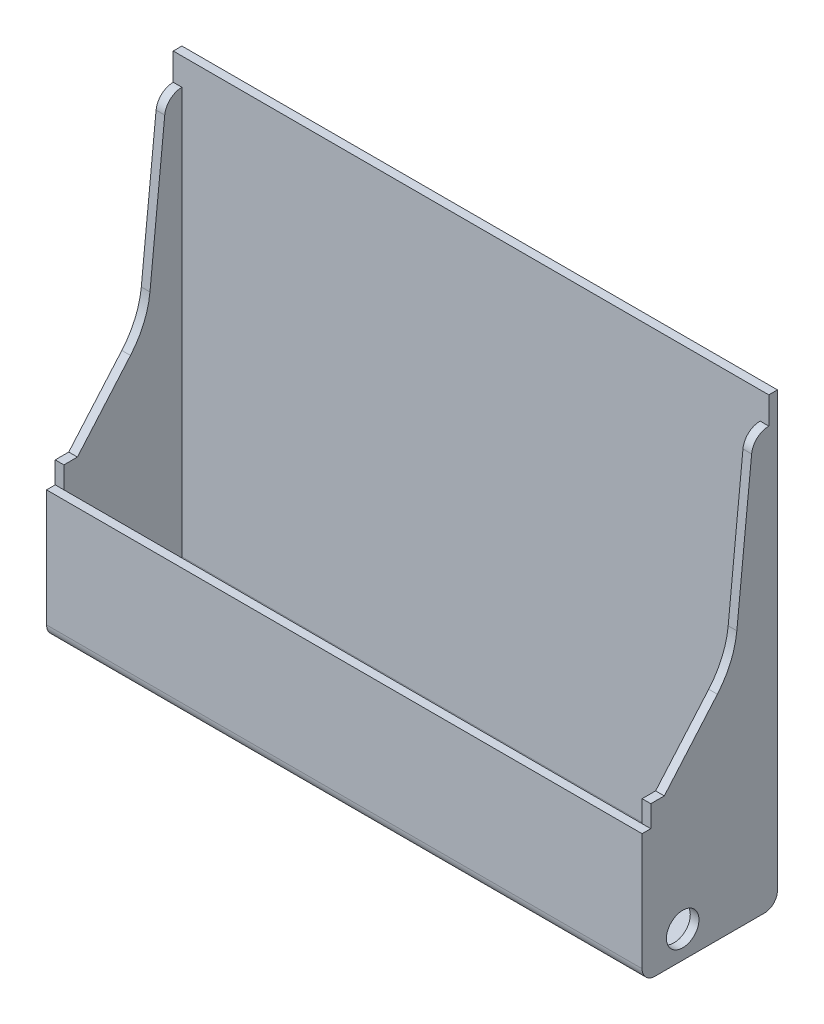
ISO-10303-21;
HEADER;
FILE_DESCRIPTION(('STEP AP214'),'2;1');
FILE_NAME('part.step','',(''),(''),'','','');
FILE_SCHEMA(('AUTOMOTIVE_DESIGN { 1 0 10303 214 1 1 1 1 }'));
ENDSEC;
DATA;
#1=APPLICATION_CONTEXT('core data for automotive mechanical design processes');
#2=APPLICATION_PROTOCOL_DEFINITION('international standard','automotive_design',2000,#1);
#3=PRODUCT_CONTEXT('',#1,'mechanical');
#4=PRODUCT('Part','Part','',(#3));
#5=PRODUCT_RELATED_PRODUCT_CATEGORY('part','',(#4));
#6=PRODUCT_DEFINITION_FORMATION('','',#4);
#7=PRODUCT_DEFINITION_CONTEXT('part definition',#1,'design');
#8=PRODUCT_DEFINITION('design','',#6,#7);
#9=PRODUCT_DEFINITION_SHAPE('','',#8);
#10=(LENGTH_UNIT() NAMED_UNIT(*) SI_UNIT(.MILLI.,.METRE.));
#11=(NAMED_UNIT(*) PLANE_ANGLE_UNIT() SI_UNIT($,.RADIAN.));
#12=(NAMED_UNIT(*) SI_UNIT($,.STERADIAN.) SOLID_ANGLE_UNIT());
#13=UNCERTAINTY_MEASURE_WITH_UNIT(LENGTH_MEASURE(1.E-05),#10,'distance_accuracy_value','');
#14=(GEOMETRIC_REPRESENTATION_CONTEXT(3) GLOBAL_UNCERTAINTY_ASSIGNED_CONTEXT((#13)) GLOBAL_UNIT_ASSIGNED_CONTEXT((#10,
#11,#12)) REPRESENTATION_CONTEXT('',''));
#15=CARTESIAN_POINT('',(0.,0.,0.));
#16=DIRECTION('',(0.,0.,1.));
#17=DIRECTION('',(1.,0.,0.));
#18=AXIS2_PLACEMENT_3D('',#15,#16,#17);
#19=CARTESIAN_POINT('',(-34.925,52.3875,15.875));
#20=DIRECTION('',(0.,-1.,0.));
#21=DIRECTION('',(0.,0.,-1.));
#22=AXIS2_PLACEMENT_3D('',#19,#20,#21);
#23=PLANE('',#22);
#24=DIRECTION('',(0.,0.,-1.));
#25=VECTOR('',#24,1.);
#26=CARTESIAN_POINT('',(-34.925,52.3875,15.875));
#27=LINE('',#26,#25);
#28=CARTESIAN_POINT('',(-34.925,52.3875,1.016));
#29=VERTEX_POINT('',#28);
#30=CARTESIAN_POINT('',(-34.925,52.3875,0.));
#31=VERTEX_POINT('',#30);
#32=EDGE_CURVE('E359',#29,#31,#27,.T.);
#33=ORIENTED_EDGE('',*,*,#32,.F.);
#34=DIRECTION('',(-1.,0.,0.));
#35=VECTOR('',#34,1.);
#36=CARTESIAN_POINT('',(-34.925,52.3875,1.016));
#37=LINE('',#36,#35);
#38=CARTESIAN_POINT('',(34.925,52.3875,1.016));
#39=VERTEX_POINT('',#38);
#40=EDGE_CURVE('E326',#39,#29,#37,.T.);
#41=ORIENTED_EDGE('',*,*,#40,.F.);
#42=DIRECTION('',(0.,0.,-1.));
#43=VECTOR('',#42,1.);
#44=CARTESIAN_POINT('',(34.925,52.3875,15.875));
#45=LINE('',#44,#43);
#46=CARTESIAN_POINT('',(34.925,52.3875,0.));
#47=VERTEX_POINT('',#46);
#48=EDGE_CURVE('E227',#39,#47,#45,.T.);
#49=ORIENTED_EDGE('',*,*,#48,.T.);
#50=DIRECTION('',(-1.,0.,0.));
#51=VECTOR('',#50,1.);
#52=CARTESIAN_POINT('',(-34.925,52.3875,0.));
#53=LINE('',#52,#51);
#54=EDGE_CURVE('E352',#47,#31,#53,.T.);
#55=ORIENTED_EDGE('',*,*,#54,.T.);
#56=EDGE_LOOP('',(#33,#41,#49,#55));
#57=FACE_BOUND('',#56,.T.);
#58=ADVANCED_FACE('F31',(#57),#23,.F.);
#59=CARTESIAN_POINT('',(-34.925,0.,15.875));
#60=DIRECTION('',(1.,0.,0.));
#61=DIRECTION('',(0.,0.,-1.));
#62=AXIS2_PLACEMENT_3D('',#59,#60,#61);
#63=PLANE('',#62);
#64=CARTESIAN_POINT('',(-34.925,3.175,11.1125));
#65=DIRECTION('',(1.,0.,0.));
#66=DIRECTION('',(0.,0.,-1.));
#67=AXIS2_PLACEMENT_3D('',#64,#65,#66);
#68=CIRCLE('',#67,1.905);
#69=CARTESIAN_POINT('',(-34.925,3.175,9.2075));
#70=VERTEX_POINT('',#69);
#71=EDGE_CURVE('E733',#70,#70,#68,.T.);
#72=ORIENTED_EDGE('',*,*,#71,.T.);
#73=EDGE_LOOP('',(#72));
#74=FACE_BOUND('',#73,.T.);
#75=DIRECTION('',(0.,-1.,0.));
#76=VECTOR('',#75,1.);
#77=CARTESIAN_POINT('',(-34.925,0.,15.875));
#78=LINE('',#77,#76);
#79=CARTESIAN_POINT('',(-34.925,15.24,15.875));
#80=VERTEX_POINT('',#79);
#81=CARTESIAN_POINT('',(-34.925,1.524,15.875));
#82=VERTEX_POINT('',#81);
#83=EDGE_CURVE('E55',#80,#82,#78,.T.);
#84=ORIENTED_EDGE('',*,*,#83,.F.);
#85=DIRECTION('',(0.,0.,-1.));
#86=VECTOR('',#85,1.);
#87=CARTESIAN_POINT('',(-34.925,15.24,14.859));
#88=LINE('',#87,#86);
#89=CARTESIAN_POINT('',(-34.925,15.24,14.859));
#90=VERTEX_POINT('',#89);
#91=EDGE_CURVE('E253',#80,#90,#88,.T.);
#92=ORIENTED_EDGE('',*,*,#91,.T.);
#93=DIRECTION('',(0.,1.,0.));
#94=VECTOR('',#93,1.);
#95=CARTESIAN_POINT('',(-34.925,17.78,14.859));
#96=LINE('',#95,#94);
#97=CARTESIAN_POINT('',(-34.925,17.78,14.859));
#98=VERTEX_POINT('',#97);
#99=EDGE_CURVE('E256',#90,#98,#96,.T.);
#100=ORIENTED_EDGE('',*,*,#99,.T.);
#101=DIRECTION('',(0.,0.,-1.));
#102=VECTOR('',#101,1.);
#103=CARTESIAN_POINT('',(-34.925,17.78,13.2715));
#104=LINE('',#103,#102);
#105=CARTESIAN_POINT('',(-34.925,17.78,13.2715));
#106=VERTEX_POINT('',#105);
#107=EDGE_CURVE('E259',#98,#106,#104,.T.);
#108=ORIENTED_EDGE('',*,*,#107,.T.);
#109=DIRECTION('',(0.,0.756920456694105,-0.653507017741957));
#110=VECTOR('',#109,1.);
#111=CARTESIAN_POINT('',(-34.925,24.9896673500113,7.04684565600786));
#112=LINE('',#111,#110);
#113=CARTESIAN_POINT('',(-34.925,24.9896673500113,7.04684565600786));
#114=VERTEX_POINT('',#113);
#115=EDGE_CURVE('E262',#106,#114,#112,.T.);
#116=ORIENTED_EDGE('',*,*,#115,.T.);
#117=CARTESIAN_POINT('',(-34.925,31.2626455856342,14.3124838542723));
#118=DIRECTION('',(1.,0.,0.));
#119=DIRECTION('',(0.,0.,1.));
#120=AXIS2_PLACEMENT_3D('',#117,#118,#119);
#121=CIRCLE('',#120,9.59894548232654);
#122=CARTESIAN_POINT('',(-34.925,30.2943673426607,4.7625));
#123=VERTEX_POINT('',#122);
#124=EDGE_CURVE('E265',#114,#123,#121,.T.);
#125=ORIENTED_EDGE('',*,*,#124,.T.);
#126=DIRECTION('',(0.,0.994899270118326,-0.100873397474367));
#127=VECTOR('',#126,1.);
#128=CARTESIAN_POINT('',(-34.925,47.3934461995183,3.0288147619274));
#129=LINE('',#128,#127);
#130=CARTESIAN_POINT('',(-34.925,47.3934461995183,3.0288147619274));
#131=VERTEX_POINT('',#130);
#132=EDGE_CURVE('E212',#123,#131,#129,.T.);
#133=ORIENTED_EDGE('',*,*,#132,.T.);
#134=CARTESIAN_POINT('',(-34.925,47.1893657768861,1.016));
#135=DIRECTION('',(-1.,0.,0.));
#136=DIRECTION('',(0.,0.,-1.));
#137=AXIS2_PLACEMENT_3D('',#134,#135,#136);
#138=CIRCLE('',#137,2.02313422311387);
#139=CARTESIAN_POINT('',(-34.925,49.2125,1.016));
#140=VERTEX_POINT('',#139);
#141=EDGE_CURVE('E247',#131,#140,#138,.T.);
#142=ORIENTED_EDGE('',*,*,#141,.T.);
#143=DIRECTION('',(0.,1.,0.));
#144=VECTOR('',#143,1.);
#145=CARTESIAN_POINT('',(-34.925,49.2125,1.016));
#146=LINE('',#145,#144);
#147=EDGE_CURVE('E250',#140,#29,#146,.T.);
#148=ORIENTED_EDGE('',*,*,#147,.T.);
#149=ORIENTED_EDGE('',*,*,#32,.T.);
#150=DIRECTION('',(0.,-1.,0.));
#151=VECTOR('',#150,1.);
#152=CARTESIAN_POINT('',(-34.925,0.,0.));
#153=LINE('',#152,#151);
#154=CARTESIAN_POINT('',(-34.925,1.524,0.));
#155=VERTEX_POINT('',#154);
#156=EDGE_CURVE('E344',#31,#155,#153,.T.);
#157=ORIENTED_EDGE('',*,*,#156,.T.);
#158=CARTESIAN_POINT('',(-34.925,1.524,1.524));
#159=DIRECTION('',(1.,0.,0.));
#160=DIRECTION('',(0.,0.,-1.));
#161=AXIS2_PLACEMENT_3D('',#158,#159,#160);
#162=CIRCLE('',#161,1.524);
#163=CARTESIAN_POINT('',(-34.925,0.,1.524));
#164=VERTEX_POINT('',#163);
#165=EDGE_CURVE('E381',#155,#164,#162,.F.);
#166=ORIENTED_EDGE('',*,*,#165,.T.);
#167=DIRECTION('',(0.,0.,-1.));
#168=VECTOR('',#167,1.);
#169=CARTESIAN_POINT('',(-34.925,0.,15.875));
#170=LINE('',#169,#168);
#171=CARTESIAN_POINT('',(-34.925,0.,14.351));
#172=VERTEX_POINT('',#171);
#173=EDGE_CURVE('E365',#172,#164,#170,.T.);
#174=ORIENTED_EDGE('',*,*,#173,.F.);
#175=CARTESIAN_POINT('',(-34.925,1.524,14.351));
#176=DIRECTION('',(1.,0.,0.));
#177=DIRECTION('',(0.,0.,-1.));
#178=AXIS2_PLACEMENT_3D('',#175,#176,#177);
#179=CIRCLE('',#178,1.524);
#180=EDGE_CURVE('E379',#172,#82,#179,.F.);
#181=ORIENTED_EDGE('',*,*,#180,.T.);
#182=EDGE_LOOP('',(#84,#92,#100,#108,#116,#125,#133,#142,#148,#149,#157,#166,#174,#181));
#183=FACE_BOUND('',#182,.T.);
#184=ADVANCED_FACE('F33',(#74,#183),#63,.F.);
#185=CARTESIAN_POINT('',(-34.925,0.,15.875));
#186=DIRECTION('',(0.,1.,0.));
#187=DIRECTION('',(0.,0.,1.));
#188=AXIS2_PLACEMENT_3D('',#185,#186,#187);
#189=PLANE('',#188);
#190=ORIENTED_EDGE('',*,*,#173,.T.);
#191=DIRECTION('',(1.,0.,0.));
#192=VECTOR('',#191,1.);
#193=CARTESIAN_POINT('',(34.925,0.,1.524));
#194=LINE('',#193,#192);
#195=CARTESIAN_POINT('',(34.925,0.,1.524));
#196=VERTEX_POINT('',#195);
#197=EDGE_CURVE('E370',#164,#196,#194,.T.);
#198=ORIENTED_EDGE('',*,*,#197,.T.);
#199=DIRECTION('',(0.,0.,-1.));
#200=VECTOR('',#199,1.);
#201=CARTESIAN_POINT('',(34.925,0.,15.875));
#202=LINE('',#201,#200);
#203=CARTESIAN_POINT('',(34.925,0.,14.351));
#204=VERTEX_POINT('',#203);
#205=EDGE_CURVE('E362',#204,#196,#202,.T.);
#206=ORIENTED_EDGE('',*,*,#205,.F.);
#207=DIRECTION('',(1.,0.,0.));
#208=VECTOR('',#207,1.);
#209=CARTESIAN_POINT('',(-34.925,0.,14.351));
#210=LINE('',#209,#208);
#211=EDGE_CURVE('E368',#204,#172,#210,.F.);
#212=ORIENTED_EDGE('',*,*,#211,.T.);
#213=EDGE_LOOP('',(#190,#198,#206,#212));
#214=FACE_BOUND('',#213,.T.);
#215=ADVANCED_FACE('F450',(#214),#189,.F.);
#216=CARTESIAN_POINT('',(34.925,0.,15.875));
#217=DIRECTION('',(-1.,0.,0.));
#218=DIRECTION('',(0.,0.,1.));
#219=AXIS2_PLACEMENT_3D('',#216,#217,#218);
#220=PLANE('',#219);
#221=CARTESIAN_POINT('',(34.925,3.175,11.1125));
#222=DIRECTION('',(1.,0.,0.));
#223=DIRECTION('',(0.,0.,-1.));
#224=AXIS2_PLACEMENT_3D('',#221,#222,#223);
#225=CIRCLE('',#224,1.905);
#226=CARTESIAN_POINT('',(34.925,3.175,9.2075));
#227=VERTEX_POINT('',#226);
#228=EDGE_CURVE('E732',#227,#227,#225,.T.);
#229=ORIENTED_EDGE('',*,*,#228,.F.);
#230=EDGE_LOOP('',(#229));
#231=FACE_BOUND('',#230,.T.);
#232=DIRECTION('',(0.,1.,0.));
#233=VECTOR('',#232,1.);
#234=CARTESIAN_POINT('',(34.925,17.78,14.859));
#235=LINE('',#234,#233);
#236=CARTESIAN_POINT('',(34.925,15.24,14.859));
#237=VERTEX_POINT('',#236);
#238=CARTESIAN_POINT('',(34.925,17.78,14.859));
#239=VERTEX_POINT('',#238);
#240=EDGE_CURVE('E230',#237,#239,#235,.T.);
#241=ORIENTED_EDGE('',*,*,#240,.F.);
#242=DIRECTION('',(0.,0.,-1.));
#243=VECTOR('',#242,1.);
#244=CARTESIAN_POINT('',(34.925,15.24,14.859));
#245=LINE('',#244,#243);
#246=CARTESIAN_POINT('',(34.925,15.24,15.875));
#247=VERTEX_POINT('',#246);
#248=EDGE_CURVE('E228',#247,#237,#245,.T.);
#249=ORIENTED_EDGE('',*,*,#248,.F.);
#250=DIRECTION('',(0.,1.,0.));
#251=VECTOR('',#250,1.);
#252=CARTESIAN_POINT('',(34.925,0.,15.875));
#253=LINE('',#252,#251);
#254=CARTESIAN_POINT('',(34.925,1.524,15.875));
#255=VERTEX_POINT('',#254);
#256=EDGE_CURVE('E356',#255,#247,#253,.T.);
#257=ORIENTED_EDGE('',*,*,#256,.F.);
#258=CARTESIAN_POINT('',(34.925,1.524,14.351));
#259=DIRECTION('',(-1.,0.,0.));
#260=DIRECTION('',(0.,0.,1.));
#261=AXIS2_PLACEMENT_3D('',#258,#259,#260);
#262=CIRCLE('',#261,1.524);
#263=EDGE_CURVE('E373',#255,#204,#262,.F.);
#264=ORIENTED_EDGE('',*,*,#263,.T.);
#265=ORIENTED_EDGE('',*,*,#205,.T.);
#266=CARTESIAN_POINT('',(34.925,1.524,1.524));
#267=DIRECTION('',(-1.,0.,0.));
#268=DIRECTION('',(0.,0.,1.));
#269=AXIS2_PLACEMENT_3D('',#266,#267,#268);
#270=CIRCLE('',#269,1.524);
#271=CARTESIAN_POINT('',(34.925,1.524,0.));
#272=VERTEX_POINT('',#271);
#273=EDGE_CURVE('E375',#196,#272,#270,.F.);
#274=ORIENTED_EDGE('',*,*,#273,.T.);
#275=DIRECTION('',(0.,1.,0.));
#276=VECTOR('',#275,1.);
#277=CARTESIAN_POINT('',(34.925,0.,0.));
#278=LINE('',#277,#276);
#279=EDGE_CURVE('E350',#272,#47,#278,.T.);
#280=ORIENTED_EDGE('',*,*,#279,.T.);
#281=ORIENTED_EDGE('',*,*,#48,.F.);
#282=DIRECTION('',(0.,1.,0.));
#283=VECTOR('',#282,1.);
#284=CARTESIAN_POINT('',(34.925,49.2125,1.016));
#285=LINE('',#284,#283);
#286=CARTESIAN_POINT('',(34.925,49.2125,1.016));
#287=VERTEX_POINT('',#286);
#288=EDGE_CURVE('E204',#287,#39,#285,.T.);
#289=ORIENTED_EDGE('',*,*,#288,.F.);
#290=CARTESIAN_POINT('',(34.925,47.1893657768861,1.016));
#291=DIRECTION('',(-1.,0.,0.));
#292=DIRECTION('',(0.,0.,-1.));
#293=AXIS2_PLACEMENT_3D('',#290,#291,#292);
#294=CIRCLE('',#293,2.02313422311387);
#295=CARTESIAN_POINT('',(34.925,47.3934461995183,3.0288147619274));
#296=VERTEX_POINT('',#295);
#297=EDGE_CURVE('E215',#296,#287,#294,.T.);
#298=ORIENTED_EDGE('',*,*,#297,.F.);
#299=DIRECTION('',(0.,0.994899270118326,-0.100873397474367));
#300=VECTOR('',#299,1.);
#301=CARTESIAN_POINT('',(34.925,47.3934461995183,3.0288147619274));
#302=LINE('',#301,#300);
#303=CARTESIAN_POINT('',(34.925,30.2943673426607,4.7625));
#304=VERTEX_POINT('',#303);
#305=EDGE_CURVE('E245',#304,#296,#302,.T.);
#306=ORIENTED_EDGE('',*,*,#305,.F.);
#307=CARTESIAN_POINT('',(34.925,31.2626455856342,14.3124838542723));
#308=DIRECTION('',(1.,0.,0.));
#309=DIRECTION('',(0.,0.,1.));
#310=AXIS2_PLACEMENT_3D('',#307,#308,#309);
#311=CIRCLE('',#310,9.59894548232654);
#312=CARTESIAN_POINT('',(34.925,24.9896673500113,7.04684565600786));
#313=VERTEX_POINT('',#312);
#314=EDGE_CURVE('E242',#313,#304,#311,.T.);
#315=ORIENTED_EDGE('',*,*,#314,.F.);
#316=DIRECTION('',(0.,0.756920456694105,-0.653507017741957));
#317=VECTOR('',#316,1.);
#318=CARTESIAN_POINT('',(34.925,24.9896673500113,7.04684565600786));
#319=LINE('',#318,#317);
#320=CARTESIAN_POINT('',(34.925,17.78,13.2715));
#321=VERTEX_POINT('',#320);
#322=EDGE_CURVE('E239',#321,#313,#319,.T.);
#323=ORIENTED_EDGE('',*,*,#322,.F.);
#324=DIRECTION('',(0.,0.,-1.));
#325=VECTOR('',#324,1.);
#326=CARTESIAN_POINT('',(34.925,17.78,13.2715));
#327=LINE('',#326,#325);
#328=EDGE_CURVE('E236',#239,#321,#327,.T.);
#329=ORIENTED_EDGE('',*,*,#328,.F.);
#330=EDGE_LOOP('',(#241,#249,#257,#264,#265,#274,#280,#281,#289,#298,#306,#315,#323,#329));
#331=FACE_BOUND('',#330,.T.);
#332=ADVANCED_FACE('F225',(#231,#331),#220,.F.);
#333=CARTESIAN_POINT('',(-34.925,52.3875,15.875));
#334=DIRECTION('',(0.,0.,-1.));
#335=DIRECTION('',(-1.,0.,0.));
#336=AXIS2_PLACEMENT_3D('',#333,#334,#335);
#337=PLANE('',#336);
#338=ORIENTED_EDGE('',*,*,#256,.T.);
#339=DIRECTION('',(1.,0.,0.));
#340=VECTOR('',#339,1.);
#341=CARTESIAN_POINT('',(-34.925,15.24,15.875));
#342=LINE('',#341,#340);
#343=EDGE_CURVE('E293',#80,#247,#342,.T.);
#344=ORIENTED_EDGE('',*,*,#343,.F.);
#345=ORIENTED_EDGE('',*,*,#83,.T.);
#346=DIRECTION('',(1.,0.,0.));
#347=VECTOR('',#346,1.);
#348=CARTESIAN_POINT('',(-34.925,1.524,15.875));
#349=LINE('',#348,#347);
#350=EDGE_CURVE('E383',#82,#255,#349,.T.);
#351=ORIENTED_EDGE('',*,*,#350,.T.);
#352=EDGE_LOOP('',(#338,#344,#345,#351));
#353=FACE_BOUND('',#352,.T.);
#354=ADVANCED_FACE('F443',(#353),#337,.F.);
#355=CARTESIAN_POINT('',(-34.925,52.3875,0.));
#356=DIRECTION('',(0.,0.,-1.));
#357=DIRECTION('',(-1.,0.,0.));
#358=AXIS2_PLACEMENT_3D('',#355,#356,#357);
#359=PLANE('',#358);
#360=ORIENTED_EDGE('',*,*,#279,.F.);
#361=DIRECTION('',(1.,0.,0.));
#362=VECTOR('',#361,1.);
#363=CARTESIAN_POINT('',(-34.925,1.524,0.));
#364=LINE('',#363,#362);
#365=EDGE_CURVE('E377',#272,#155,#364,.F.);
#366=ORIENTED_EDGE('',*,*,#365,.T.);
#367=ORIENTED_EDGE('',*,*,#156,.F.);
#368=ORIENTED_EDGE('',*,*,#54,.F.);
#369=EDGE_LOOP('',(#360,#366,#367,#368));
#370=FACE_BOUND('',#369,.T.);
#371=ADVANCED_FACE('F462',(#370),#359,.T.);
#372=CARTESIAN_POINT('',(-34.925,1.524,1.524));
#373=DIRECTION('',(-1.,0.,0.));
#374=DIRECTION('',(0.,0.,1.));
#375=AXIS2_PLACEMENT_3D('',#372,#373,#374);
#376=CYLINDRICAL_SURFACE('',#375,1.524);
#377=ORIENTED_EDGE('',*,*,#165,.F.);
#378=ORIENTED_EDGE('',*,*,#365,.F.);
#379=ORIENTED_EDGE('',*,*,#273,.F.);
#380=ORIENTED_EDGE('',*,*,#197,.F.);
#381=EDGE_LOOP('',(#377,#378,#379,#380));
#382=FACE_BOUND('',#381,.T.);
#383=ADVANCED_FACE('F457',(#382),#376,.T.);
#384=CARTESIAN_POINT('',(-34.925,1.524,14.351));
#385=DIRECTION('',(1.,0.,0.));
#386=DIRECTION('',(0.,0.,-1.));
#387=AXIS2_PLACEMENT_3D('',#384,#385,#386);
#388=CYLINDRICAL_SURFACE('',#387,1.524);
#389=ORIENTED_EDGE('',*,*,#180,.F.);
#390=ORIENTED_EDGE('',*,*,#211,.F.);
#391=ORIENTED_EDGE('',*,*,#263,.F.);
#392=ORIENTED_EDGE('',*,*,#350,.F.);
#393=EDGE_LOOP('',(#389,#390,#391,#392));
#394=FACE_BOUND('',#393,.T.);
#395=ADVANCED_FACE('F454',(#394),#388,.T.);
#396=CARTESIAN_POINT('',(-33.909,0.,15.875));
#397=DIRECTION('',(1.,0.,0.));
#398=DIRECTION('',(0.,0.,-1.));
#399=AXIS2_PLACEMENT_3D('',#396,#397,#398);
#400=PLANE('',#399);
#401=CARTESIAN_POINT('',(-33.909,3.175,11.1125));
#402=DIRECTION('',(1.,0.,0.));
#403=DIRECTION('',(0.,0.,-1.));
#404=AXIS2_PLACEMENT_3D('',#401,#402,#403);
#405=CIRCLE('',#404,1.905);
#406=CARTESIAN_POINT('',(-33.909,3.175,9.2075));
#407=VERTEX_POINT('',#406);
#408=EDGE_CURVE('E35',#407,#407,#405,.T.);
#409=ORIENTED_EDGE('',*,*,#408,.F.);
#410=EDGE_LOOP('',(#409));
#411=FACE_BOUND('',#410,.T.);
#412=CARTESIAN_POINT('',(-33.909,47.1893657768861,1.016));
#413=DIRECTION('',(1.,0.,0.));
#414=DIRECTION('',(0.,0.,-1.));
#415=AXIS2_PLACEMENT_3D('',#412,#413,#414);
#416=CIRCLE('',#415,2.02313422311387);
#417=CARTESIAN_POINT('',(-33.909,47.3934461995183,3.0288147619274));
#418=VERTEX_POINT('',#417);
#419=CARTESIAN_POINT('',(-33.909,49.2125,1.016));
#420=VERTEX_POINT('',#419);
#421=EDGE_CURVE('E297',#418,#420,#416,.F.);
#422=ORIENTED_EDGE('',*,*,#421,.F.);
#423=DIRECTION('',(0.,0.994899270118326,-0.100873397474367));
#424=VECTOR('',#423,1.);
#425=CARTESIAN_POINT('',(-33.909,-0.806979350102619,7.91588306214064));
#426=LINE('',#425,#424);
#427=CARTESIAN_POINT('',(-33.909,30.2943673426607,4.7625));
#428=VERTEX_POINT('',#427);
#429=EDGE_CURVE('E307',#428,#418,#426,.T.);
#430=ORIENTED_EDGE('',*,*,#429,.F.);
#431=CARTESIAN_POINT('',(-33.909,31.2626455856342,14.3124838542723));
#432=DIRECTION('',(1.,0.,0.));
#433=DIRECTION('',(0.,0.,-1.));
#434=AXIS2_PLACEMENT_3D('',#431,#432,#433);
#435=CIRCLE('',#434,9.59894548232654);
#436=CARTESIAN_POINT('',(-33.909,24.9896673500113,7.04684565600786));
#437=VERTEX_POINT('',#436);
#438=EDGE_CURVE('E305',#437,#428,#435,.T.);
#439=ORIENTED_EDGE('',*,*,#438,.F.);
#440=DIRECTION('',(0.,0.756920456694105,-0.653507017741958));
#441=VECTOR('',#440,1.);
#442=CARTESIAN_POINT('',(-33.909,6.30550124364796,23.1783077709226));
#443=LINE('',#442,#441);
#444=CARTESIAN_POINT('',(-33.909,17.78,13.2715));
#445=VERTEX_POINT('',#444);
#446=EDGE_CURVE('E303',#445,#437,#443,.T.);
#447=ORIENTED_EDGE('',*,*,#446,.F.);
#448=DIRECTION('',(0.,0.,-1.));
#449=VECTOR('',#448,1.);
#450=CARTESIAN_POINT('',(-33.909,17.78,15.875));
#451=LINE('',#450,#449);
#452=CARTESIAN_POINT('',(-33.909,17.78,14.859));
#453=VERTEX_POINT('',#452);
#454=EDGE_CURVE('E301',#453,#445,#451,.T.);
#455=ORIENTED_EDGE('',*,*,#454,.F.);
#456=DIRECTION('',(0.,-1.,0.));
#457=VECTOR('',#456,1.);
#458=CARTESIAN_POINT('',(-33.909,52.3875,14.859));
#459=LINE('',#458,#457);
#460=CARTESIAN_POINT('',(-33.909,15.24,14.859));
#461=VERTEX_POINT('',#460);
#462=EDGE_CURVE('E325',#453,#461,#459,.T.);
#463=ORIENTED_EDGE('',*,*,#462,.T.);
#464=CARTESIAN_POINT('',(-33.909,1.524,14.859));
#465=VERTEX_POINT('',#464);
#466=EDGE_CURVE('E323',#461,#465,#459,.T.);
#467=ORIENTED_EDGE('',*,*,#466,.T.);
#468=CARTESIAN_POINT('',(-33.909,1.524,14.351));
#469=DIRECTION('',(1.,0.,0.));
#470=DIRECTION('',(0.,0.,-1.));
#471=AXIS2_PLACEMENT_3D('',#468,#469,#470);
#472=CIRCLE('',#471,0.508);
#473=CARTESIAN_POINT('',(-33.909,1.016,14.351));
#474=VERTEX_POINT('',#473);
#475=EDGE_CURVE('E314',#474,#465,#472,.F.);
#476=ORIENTED_EDGE('',*,*,#475,.F.);
#477=DIRECTION('',(0.,0.,-1.));
#478=VECTOR('',#477,1.);
#479=CARTESIAN_POINT('',(-33.909,1.016,15.875));
#480=LINE('',#479,#478);
#481=CARTESIAN_POINT('',(-33.909,1.016,1.524));
#482=VERTEX_POINT('',#481);
#483=EDGE_CURVE('E315',#474,#482,#480,.T.);
#484=ORIENTED_EDGE('',*,*,#483,.T.);
#485=CARTESIAN_POINT('',(-33.909,1.524,1.524));
#486=DIRECTION('',(1.,0.,0.));
#487=DIRECTION('',(0.,0.,-1.));
#488=AXIS2_PLACEMENT_3D('',#485,#486,#487);
#489=CIRCLE('',#488,0.508);
#490=CARTESIAN_POINT('',(-33.909,1.524,1.016));
#491=VERTEX_POINT('',#490);
#492=EDGE_CURVE('E311',#491,#482,#489,.F.);
#493=ORIENTED_EDGE('',*,*,#492,.F.);
#494=DIRECTION('',(0.,-1.,0.));
#495=VECTOR('',#494,1.);
#496=CARTESIAN_POINT('',(-33.909,52.3875,1.016));
#497=LINE('',#496,#495);
#498=EDGE_CURVE('E309',#420,#491,#497,.T.);
#499=ORIENTED_EDGE('',*,*,#498,.F.);
#500=EDGE_LOOP('',(#422,#430,#439,#447,#455,#463,#467,#476,#484,#493,#499));
#501=FACE_BOUND('',#500,.T.);
#502=ADVANCED_FACE('F422',(#411,#501),#400,.T.);
#503=CARTESIAN_POINT('',(-34.925,1.016,15.875));
#504=DIRECTION('',(0.,1.,0.));
#505=DIRECTION('',(0.,0.,1.));
#506=AXIS2_PLACEMENT_3D('',#503,#504,#505);
#507=PLANE('',#506);
#508=ORIENTED_EDGE('',*,*,#483,.F.);
#509=DIRECTION('',(1.,0.,0.));
#510=VECTOR('',#509,1.);
#511=CARTESIAN_POINT('',(-34.925,1.016,14.351));
#512=LINE('',#511,#510);
#513=CARTESIAN_POINT('',(33.909,1.016,14.351));
#514=VERTEX_POINT('',#513);
#515=EDGE_CURVE('E318',#514,#474,#512,.F.);
#516=ORIENTED_EDGE('',*,*,#515,.F.);
#517=DIRECTION('',(0.,0.,-1.));
#518=VECTOR('',#517,1.);
#519=CARTESIAN_POINT('',(33.909,1.016,15.875));
#520=LINE('',#519,#518);
#521=CARTESIAN_POINT('',(33.909,1.016,1.524));
#522=VERTEX_POINT('',#521);
#523=EDGE_CURVE('E319',#514,#522,#520,.T.);
#524=ORIENTED_EDGE('',*,*,#523,.T.);
#525=DIRECTION('',(1.,0.,0.));
#526=VECTOR('',#525,1.);
#527=CARTESIAN_POINT('',(-34.925,1.016,1.524));
#528=LINE('',#527,#526);
#529=EDGE_CURVE('E327',#482,#522,#528,.T.);
#530=ORIENTED_EDGE('',*,*,#529,.F.);
#531=EDGE_LOOP('',(#508,#516,#524,#530));
#532=FACE_BOUND('',#531,.T.);
#533=ADVANCED_FACE('F428',(#532),#507,.T.);
#534=CARTESIAN_POINT('',(33.909,0.,15.875));
#535=DIRECTION('',(-1.,0.,0.));
#536=DIRECTION('',(0.,0.,1.));
#537=AXIS2_PLACEMENT_3D('',#534,#535,#536);
#538=PLANE('',#537);
#539=CARTESIAN_POINT('',(33.909,3.175,11.1125));
#540=DIRECTION('',(-1.,0.,0.));
#541=DIRECTION('',(0.,0.,1.));
#542=AXIS2_PLACEMENT_3D('',#539,#540,#541);
#543=CIRCLE('',#542,1.905);
#544=CARTESIAN_POINT('',(33.909,3.175,13.0175));
#545=VERTEX_POINT('',#544);
#546=EDGE_CURVE('E222',#545,#545,#543,.T.);
#547=ORIENTED_EDGE('',*,*,#546,.F.);
#548=EDGE_LOOP('',(#547));
#549=FACE_BOUND('',#548,.T.);
#550=CARTESIAN_POINT('',(33.909,47.1893657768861,1.016));
#551=DIRECTION('',(-1.,0.,0.));
#552=DIRECTION('',(0.,0.,1.));
#553=AXIS2_PLACEMENT_3D('',#550,#551,#552);
#554=CIRCLE('',#553,2.02313422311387);
#555=CARTESIAN_POINT('',(33.909,49.2125,1.016));
#556=VERTEX_POINT('',#555);
#557=CARTESIAN_POINT('',(33.909,47.3934461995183,3.0288147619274));
#558=VERTEX_POINT('',#557);
#559=EDGE_CURVE('E273',#556,#558,#554,.F.);
#560=ORIENTED_EDGE('',*,*,#559,.F.);
#561=DIRECTION('',(0.,1.,0.));
#562=VECTOR('',#561,1.);
#563=CARTESIAN_POINT('',(33.909,52.3875,1.016));
#564=LINE('',#563,#562);
#565=CARTESIAN_POINT('',(33.909,1.524,1.016));
#566=VERTEX_POINT('',#565);
#567=EDGE_CURVE('E208',#566,#556,#564,.T.);
#568=ORIENTED_EDGE('',*,*,#567,.F.);
#569=CARTESIAN_POINT('',(33.909,1.524,1.524));
#570=DIRECTION('',(-1.,0.,0.));
#571=DIRECTION('',(0.,0.,1.));
#572=AXIS2_PLACEMENT_3D('',#569,#570,#571);
#573=CIRCLE('',#572,0.508);
#574=EDGE_CURVE('E335',#522,#566,#573,.F.);
#575=ORIENTED_EDGE('',*,*,#574,.F.);
#576=ORIENTED_EDGE('',*,*,#523,.F.);
#577=CARTESIAN_POINT('',(33.909,1.524,14.351));
#578=DIRECTION('',(-1.,0.,0.));
#579=DIRECTION('',(0.,0.,1.));
#580=AXIS2_PLACEMENT_3D('',#577,#578,#579);
#581=CIRCLE('',#580,0.508);
#582=CARTESIAN_POINT('',(33.909,1.524,14.859));
#583=VERTEX_POINT('',#582);
#584=EDGE_CURVE('E330',#583,#514,#581,.F.);
#585=ORIENTED_EDGE('',*,*,#584,.F.);
#586=DIRECTION('',(0.,1.,0.));
#587=VECTOR('',#586,1.);
#588=CARTESIAN_POINT('',(33.909,52.3875,14.859));
#589=LINE('',#588,#587);
#590=CARTESIAN_POINT('',(33.909,15.24,14.859));
#591=VERTEX_POINT('',#590);
#592=EDGE_CURVE('E333',#583,#591,#589,.T.);
#593=ORIENTED_EDGE('',*,*,#592,.T.);
#594=CARTESIAN_POINT('',(33.909,17.78,14.859));
#595=VERTEX_POINT('',#594);
#596=EDGE_CURVE('E340',#591,#595,#589,.T.);
#597=ORIENTED_EDGE('',*,*,#596,.T.);
#598=DIRECTION('',(0.,0.,1.));
#599=VECTOR('',#598,1.);
#600=CARTESIAN_POINT('',(33.909,17.78,15.875));
#601=LINE('',#600,#599);
#602=CARTESIAN_POINT('',(33.909,17.78,13.2715));
#603=VERTEX_POINT('',#602);
#604=EDGE_CURVE('E299',#603,#595,#601,.T.);
#605=ORIENTED_EDGE('',*,*,#604,.F.);
#606=DIRECTION('',(0.,-0.756920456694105,0.653507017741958));
#607=VECTOR('',#606,1.);
#608=CARTESIAN_POINT('',(33.909,6.30550124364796,23.1783077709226));
#609=LINE('',#608,#607);
#610=CARTESIAN_POINT('',(33.909,24.9896673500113,7.04684565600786));
#611=VERTEX_POINT('',#610);
#612=EDGE_CURVE('E387',#611,#603,#609,.T.);
#613=ORIENTED_EDGE('',*,*,#612,.F.);
#614=CARTESIAN_POINT('',(33.909,31.2626455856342,14.3124838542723));
#615=DIRECTION('',(-1.,0.,0.));
#616=DIRECTION('',(0.,0.,1.));
#617=AXIS2_PLACEMENT_3D('',#614,#615,#616);
#618=CIRCLE('',#617,9.59894548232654);
#619=CARTESIAN_POINT('',(33.909,30.2943673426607,4.7625));
#620=VERTEX_POINT('',#619);
#621=EDGE_CURVE('E40',#620,#611,#618,.T.);
#622=ORIENTED_EDGE('',*,*,#621,.F.);
#623=DIRECTION('',(0.,-0.994899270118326,0.100873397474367));
#624=VECTOR('',#623,1.);
#625=CARTESIAN_POINT('',(33.909,-0.806979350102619,7.91588306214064));
#626=LINE('',#625,#624);
#627=EDGE_CURVE('E11',#558,#620,#626,.T.);
#628=ORIENTED_EDGE('',*,*,#627,.F.);
#629=EDGE_LOOP('',(#560,#568,#575,#576,#585,#593,#597,#605,#613,#622,#628));
#630=FACE_BOUND('',#629,.T.);
#631=ADVANCED_FACE('F403',(#549,#630),#538,.T.);
#632=CARTESIAN_POINT('',(-34.925,52.3875,14.859));
#633=DIRECTION('',(0.,0.,-1.));
#634=DIRECTION('',(-1.,0.,0.));
#635=AXIS2_PLACEMENT_3D('',#632,#633,#634);
#636=PLANE('',#635);
#637=DIRECTION('',(-1.,0.,0.));
#638=VECTOR('',#637,1.);
#639=CARTESIAN_POINT('',(-34.925,15.24,14.859));
#640=LINE('',#639,#638);
#641=EDGE_CURVE('E385',#591,#461,#640,.T.);
#642=ORIENTED_EDGE('',*,*,#641,.F.);
#643=ORIENTED_EDGE('',*,*,#592,.F.);
#644=DIRECTION('',(-1.,0.,0.));
#645=VECTOR('',#644,1.);
#646=CARTESIAN_POINT('',(-34.925,1.524,14.859));
#647=LINE('',#646,#645);
#648=EDGE_CURVE('E313',#465,#583,#647,.F.);
#649=ORIENTED_EDGE('',*,*,#648,.F.);
#650=ORIENTED_EDGE('',*,*,#466,.F.);
#651=EDGE_LOOP('',(#642,#643,#649,#650));
#652=FACE_BOUND('',#651,.T.);
#653=ADVANCED_FACE('F435',(#652),#636,.T.);
#654=CARTESIAN_POINT('',(-34.925,52.3875,1.016));
#655=DIRECTION('',(0.,0.,-1.));
#656=DIRECTION('',(-1.,0.,0.));
#657=AXIS2_PLACEMENT_3D('',#654,#655,#656);
#658=PLANE('',#657);
#659=ORIENTED_EDGE('',*,*,#567,.T.);
#660=DIRECTION('',(1.,0.,0.));
#661=VECTOR('',#660,1.);
#662=CARTESIAN_POINT('',(-34.925,49.2125,1.016));
#663=LINE('',#662,#661);
#664=EDGE_CURVE('E200',#556,#287,#663,.T.);
#665=ORIENTED_EDGE('',*,*,#664,.T.);
#666=ORIENTED_EDGE('',*,*,#288,.T.);
#667=ORIENTED_EDGE('',*,*,#40,.T.);
#668=ORIENTED_EDGE('',*,*,#147,.F.);
#669=EDGE_CURVE('E211',#140,#420,#663,.T.);
#670=ORIENTED_EDGE('',*,*,#669,.T.);
#671=ORIENTED_EDGE('',*,*,#498,.T.);
#672=DIRECTION('',(-1.,0.,0.));
#673=VECTOR('',#672,1.);
#674=CARTESIAN_POINT('',(-34.925,1.524,1.016));
#675=LINE('',#674,#673);
#676=EDGE_CURVE('E322',#566,#491,#675,.T.);
#677=ORIENTED_EDGE('',*,*,#676,.F.);
#678=EDGE_LOOP('',(#659,#665,#666,#667,#668,#670,#671,#677));
#679=FACE_BOUND('',#678,.T.);
#680=ADVANCED_FACE('F202',(#679),#658,.F.);
#681=CARTESIAN_POINT('',(-34.925,1.524,1.524));
#682=DIRECTION('',(-1.,0.,0.));
#683=DIRECTION('',(0.,0.,1.));
#684=AXIS2_PLACEMENT_3D('',#681,#682,#683);
#685=CYLINDRICAL_SURFACE('',#684,0.508);
#686=ORIENTED_EDGE('',*,*,#492,.T.);
#687=ORIENTED_EDGE('',*,*,#529,.T.);
#688=ORIENTED_EDGE('',*,*,#574,.T.);
#689=ORIENTED_EDGE('',*,*,#676,.T.);
#690=EDGE_LOOP('',(#686,#687,#688,#689));
#691=FACE_BOUND('',#690,.T.);
#692=ADVANCED_FACE('F419',(#691),#685,.F.);
#693=CARTESIAN_POINT('',(-34.925,1.524,14.351));
#694=DIRECTION('',(1.,0.,0.));
#695=DIRECTION('',(0.,0.,-1.));
#696=AXIS2_PLACEMENT_3D('',#693,#694,#695);
#697=CYLINDRICAL_SURFACE('',#696,0.508);
#698=ORIENTED_EDGE('',*,*,#475,.T.);
#699=ORIENTED_EDGE('',*,*,#648,.T.);
#700=ORIENTED_EDGE('',*,*,#584,.T.);
#701=ORIENTED_EDGE('',*,*,#515,.T.);
#702=EDGE_LOOP('',(#698,#699,#700,#701));
#703=FACE_BOUND('',#702,.T.);
#704=ADVANCED_FACE('F432',(#703),#697,.F.);
#705=CARTESIAN_POINT('',(-34.925,47.3934461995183,3.0288147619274));
#706=DIRECTION('',(0.,-0.100873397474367,-0.994899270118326));
#707=DIRECTION('',(0.,0.994899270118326,-0.100873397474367));
#708=AXIS2_PLACEMENT_3D('',#705,#706,#707);
#709=PLANE('',#708);
#710=ORIENTED_EDGE('',*,*,#429,.T.);
#711=DIRECTION('',(1.,0.,0.));
#712=VECTOR('',#711,1.);
#713=CARTESIAN_POINT('',(-34.925,47.3934461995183,3.0288147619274));
#714=LINE('',#713,#712);
#715=EDGE_CURVE('E270',#131,#418,#714,.T.);
#716=ORIENTED_EDGE('',*,*,#715,.F.);
#717=ORIENTED_EDGE('',*,*,#132,.F.);
#718=DIRECTION('',(1.,0.,0.));
#719=VECTOR('',#718,1.);
#720=CARTESIAN_POINT('',(-34.925,30.2943673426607,4.7625));
#721=LINE('',#720,#719);
#722=EDGE_CURVE('E274',#123,#428,#721,.T.);
#723=ORIENTED_EDGE('',*,*,#722,.T.);
#724=EDGE_LOOP('',(#710,#716,#717,#723));
#725=FACE_BOUND('',#724,.T.);
#726=ADVANCED_FACE('F475',(#725),#709,.F.);
#727=CARTESIAN_POINT('',(-34.925,31.2626455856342,14.3124838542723));
#728=DIRECTION('',(1.,0.,0.));
#729=DIRECTION('',(0.,0.,-1.));
#730=AXIS2_PLACEMENT_3D('',#727,#728,#729);
#731=CYLINDRICAL_SURFACE('',#730,9.59894548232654);
#732=ORIENTED_EDGE('',*,*,#438,.T.);
#733=ORIENTED_EDGE('',*,*,#722,.F.);
#734=ORIENTED_EDGE('',*,*,#124,.F.);
#735=DIRECTION('',(1.,0.,0.));
#736=VECTOR('',#735,1.);
#737=CARTESIAN_POINT('',(-34.925,24.9896673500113,7.04684565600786));
#738=LINE('',#737,#736);
#739=EDGE_CURVE('E278',#114,#437,#738,.T.);
#740=ORIENTED_EDGE('',*,*,#739,.T.);
#741=EDGE_LOOP('',(#732,#733,#734,#740));
#742=FACE_BOUND('',#741,.T.);
#743=ADVANCED_FACE('F478',(#742),#731,.F.);
#744=CARTESIAN_POINT('',(-34.925,24.9896673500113,7.04684565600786));
#745=DIRECTION('',(0.,-0.653507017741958,-0.756920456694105));
#746=DIRECTION('',(0.,0.756920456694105,-0.653507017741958));
#747=AXIS2_PLACEMENT_3D('',#744,#745,#746);
#748=PLANE('',#747);
#749=ORIENTED_EDGE('',*,*,#446,.T.);
#750=ORIENTED_EDGE('',*,*,#739,.F.);
#751=ORIENTED_EDGE('',*,*,#115,.F.);
#752=DIRECTION('',(1.,0.,0.));
#753=VECTOR('',#752,1.);
#754=CARTESIAN_POINT('',(-34.925,17.78,13.2715));
#755=LINE('',#754,#753);
#756=EDGE_CURVE('E282',#106,#445,#755,.T.);
#757=ORIENTED_EDGE('',*,*,#756,.T.);
#758=EDGE_LOOP('',(#749,#750,#751,#757));
#759=FACE_BOUND('',#758,.T.);
#760=ADVANCED_FACE('F481',(#759),#748,.F.);
#761=CARTESIAN_POINT('',(-34.925,17.78,14.859));
#762=DIRECTION('',(0.,0.,-1.));
#763=DIRECTION('',(-1.,0.,0.));
#764=AXIS2_PLACEMENT_3D('',#761,#762,#763);
#765=PLANE('',#764);
#766=ORIENTED_EDGE('',*,*,#462,.F.);
#767=DIRECTION('',(1.,0.,0.));
#768=VECTOR('',#767,1.);
#769=CARTESIAN_POINT('',(-34.925,17.78,14.859));
#770=LINE('',#769,#768);
#771=EDGE_CURVE('E286',#98,#453,#770,.T.);
#772=ORIENTED_EDGE('',*,*,#771,.F.);
#773=ORIENTED_EDGE('',*,*,#99,.F.);
#774=DIRECTION('',(1.,0.,0.));
#775=VECTOR('',#774,1.);
#776=CARTESIAN_POINT('',(-34.925,15.24,14.859));
#777=LINE('',#776,#775);
#778=EDGE_CURVE('E290',#90,#461,#777,.T.);
#779=ORIENTED_EDGE('',*,*,#778,.T.);
#780=EDGE_LOOP('',(#766,#772,#773,#779));
#781=FACE_BOUND('',#780,.T.);
#782=ADVANCED_FACE('F440',(#781),#765,.F.);
#783=CARTESIAN_POINT('',(-34.925,17.78,13.2715));
#784=DIRECTION('',(0.,-1.,0.));
#785=DIRECTION('',(0.,0.,-1.));
#786=AXIS2_PLACEMENT_3D('',#783,#784,#785);
#787=PLANE('',#786);
#788=ORIENTED_EDGE('',*,*,#454,.T.);
#789=ORIENTED_EDGE('',*,*,#756,.F.);
#790=ORIENTED_EDGE('',*,*,#107,.F.);
#791=ORIENTED_EDGE('',*,*,#771,.T.);
#792=EDGE_LOOP('',(#788,#789,#790,#791));
#793=FACE_BOUND('',#792,.T.);
#794=ADVANCED_FACE('F484',(#793),#787,.F.);
#795=CARTESIAN_POINT('',(-34.925,47.1893657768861,1.016));
#796=DIRECTION('',(1.,0.,0.));
#797=DIRECTION('',(0.,0.,-1.));
#798=AXIS2_PLACEMENT_3D('',#795,#796,#797);
#799=CYLINDRICAL_SURFACE('',#798,2.02313422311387);
#800=ORIENTED_EDGE('',*,*,#421,.T.);
#801=ORIENTED_EDGE('',*,*,#669,.F.);
#802=ORIENTED_EDGE('',*,*,#141,.F.);
#803=ORIENTED_EDGE('',*,*,#715,.T.);
#804=EDGE_LOOP('',(#800,#801,#802,#803));
#805=FACE_BOUND('',#804,.T.);
#806=ADVANCED_FACE('F470',(#805),#799,.T.);
#807=ORIENTED_EDGE('',*,*,#559,.T.);
#808=EDGE_CURVE('E218',#558,#296,#714,.T.);
#809=ORIENTED_EDGE('',*,*,#808,.T.);
#810=ORIENTED_EDGE('',*,*,#297,.T.);
#811=ORIENTED_EDGE('',*,*,#664,.F.);
#812=EDGE_LOOP('',(#807,#809,#810,#811));
#813=FACE_BOUND('',#812,.T.);
#814=ADVANCED_FACE('F216',(#813),#799,.T.);
#815=ORIENTED_EDGE('',*,*,#627,.T.);
#816=EDGE_CURVE('E277',#620,#304,#721,.T.);
#817=ORIENTED_EDGE('',*,*,#816,.T.);
#818=ORIENTED_EDGE('',*,*,#305,.T.);
#819=ORIENTED_EDGE('',*,*,#808,.F.);
#820=EDGE_LOOP('',(#815,#817,#818,#819));
#821=FACE_BOUND('',#820,.T.);
#822=ADVANCED_FACE('F414',(#821),#709,.F.);
#823=ORIENTED_EDGE('',*,*,#621,.T.);
#824=EDGE_CURVE('E281',#611,#313,#738,.T.);
#825=ORIENTED_EDGE('',*,*,#824,.T.);
#826=ORIENTED_EDGE('',*,*,#314,.T.);
#827=ORIENTED_EDGE('',*,*,#816,.F.);
#828=EDGE_LOOP('',(#823,#825,#826,#827));
#829=FACE_BOUND('',#828,.T.);
#830=ADVANCED_FACE('F393',(#829),#731,.F.);
#831=ORIENTED_EDGE('',*,*,#612,.T.);
#832=EDGE_CURVE('E285',#603,#321,#755,.T.);
#833=ORIENTED_EDGE('',*,*,#832,.T.);
#834=ORIENTED_EDGE('',*,*,#322,.T.);
#835=ORIENTED_EDGE('',*,*,#824,.F.);
#836=EDGE_LOOP('',(#831,#833,#834,#835));
#837=FACE_BOUND('',#836,.T.);
#838=ADVANCED_FACE('F398',(#837),#748,.F.);
#839=ORIENTED_EDGE('',*,*,#604,.T.);
#840=EDGE_CURVE('E289',#595,#239,#770,.T.);
#841=ORIENTED_EDGE('',*,*,#840,.T.);
#842=ORIENTED_EDGE('',*,*,#328,.T.);
#843=ORIENTED_EDGE('',*,*,#832,.F.);
#844=EDGE_LOOP('',(#839,#841,#842,#843));
#845=FACE_BOUND('',#844,.T.);
#846=ADVANCED_FACE('F407',(#845),#787,.F.);
#847=ORIENTED_EDGE('',*,*,#596,.F.);
#848=EDGE_CURVE('E47',#591,#237,#777,.T.);
#849=ORIENTED_EDGE('',*,*,#848,.T.);
#850=ORIENTED_EDGE('',*,*,#240,.T.);
#851=ORIENTED_EDGE('',*,*,#840,.F.);
#852=EDGE_LOOP('',(#847,#849,#850,#851));
#853=FACE_BOUND('',#852,.T.);
#854=ADVANCED_FACE('F409',(#853),#765,.F.);
#855=CARTESIAN_POINT('',(-34.925,15.24,14.859));
#856=DIRECTION('',(0.,-1.,0.));
#857=DIRECTION('',(0.,0.,-1.));
#858=AXIS2_PLACEMENT_3D('',#855,#856,#857);
#859=PLANE('',#858);
#860=ORIENTED_EDGE('',*,*,#248,.T.);
#861=ORIENTED_EDGE('',*,*,#848,.F.);
#862=ORIENTED_EDGE('',*,*,#641,.T.);
#863=ORIENTED_EDGE('',*,*,#778,.F.);
#864=ORIENTED_EDGE('',*,*,#91,.F.);
#865=ORIENTED_EDGE('',*,*,#343,.T.);
#866=EDGE_LOOP('',(#860,#861,#862,#863,#864,#865));
#867=FACE_BOUND('',#866,.T.);
#868=ADVANCED_FACE('F437',(#867),#859,.F.);
#869=CARTESIAN_POINT('',(-34.925,3.175,11.1125));
#870=DIRECTION('',(1.,0.,0.));
#871=DIRECTION('',(0.,0.,-1.));
#872=AXIS2_PLACEMENT_3D('',#869,#870,#871);
#873=CYLINDRICAL_SURFACE('',#872,1.905);
#874=ORIENTED_EDGE('',*,*,#408,.T.);
#875=EDGE_LOOP('',(#874));
#876=FACE_BOUND('',#875,.T.);
#877=ORIENTED_EDGE('',*,*,#71,.F.);
#878=EDGE_LOOP('',(#877));
#879=FACE_BOUND('',#878,.T.);
#880=ADVANCED_FACE('F662',(#876,#879),#873,.F.);
#881=ORIENTED_EDGE('',*,*,#546,.T.);
#882=EDGE_LOOP('',(#881));
#883=FACE_BOUND('',#882,.T.);
#884=ORIENTED_EDGE('',*,*,#228,.T.);
#885=EDGE_LOOP('',(#884));
#886=FACE_BOUND('',#885,.T.);
#887=ADVANCED_FACE('F714',(#883,#886),#873,.F.);
#888=CLOSED_SHELL('',(#58,#184,#215,#332,#354,#371,#383,#395,#502,#533,#631,#653,#680,#692,#704,
#726,#743,#760,#782,#794,#806,#814,#822,#830,#838,#846,#854,#868,#880,#887));
#889=MANIFOLD_SOLID_BREP('B2',#888);
#890=ADVANCED_BREP_SHAPE_REPRESENTATION('',(#18,#889),#14);
#891=SHAPE_DEFINITION_REPRESENTATION(#9,#890);
ENDSEC;
END-ISO-10303-21;
